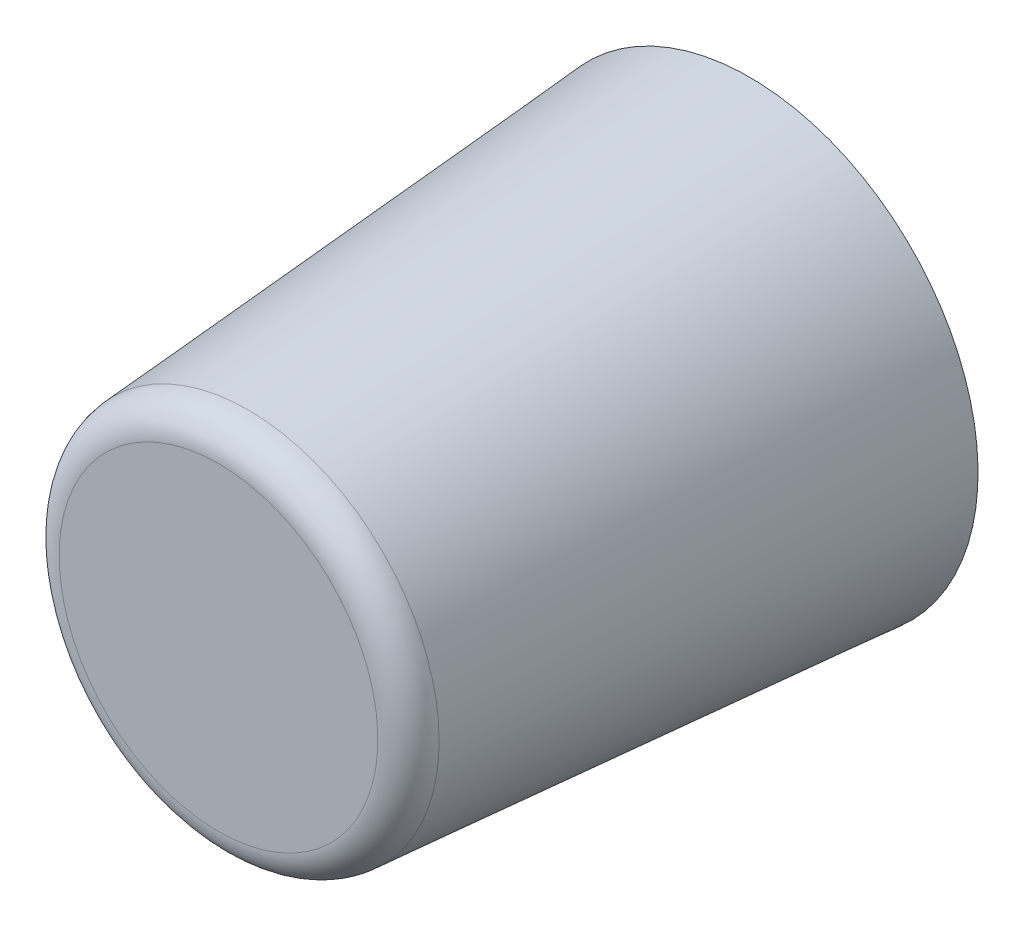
ISO-10303-21;
HEADER;
FILE_DESCRIPTION(('STEP AP214'),'2;1');
FILE_NAME('part.step','',(''),(''),'','','');
FILE_SCHEMA(('AUTOMOTIVE_DESIGN { 1 0 10303 214 1 1 1 1 }'));
ENDSEC;
DATA;
#1=APPLICATION_CONTEXT('core data for automotive mechanical design processes');
#2=APPLICATION_PROTOCOL_DEFINITION('international standard','automotive_design',2000,#1);
#3=PRODUCT_CONTEXT('',#1,'mechanical');
#4=PRODUCT('Part','Part','',(#3));
#5=PRODUCT_RELATED_PRODUCT_CATEGORY('part','',(#4));
#6=PRODUCT_DEFINITION_FORMATION('','',#4);
#7=PRODUCT_DEFINITION_CONTEXT('part definition',#1,'design');
#8=PRODUCT_DEFINITION('design','',#6,#7);
#9=PRODUCT_DEFINITION_SHAPE('','',#8);
#10=(LENGTH_UNIT() NAMED_UNIT(*) SI_UNIT(.MILLI.,.METRE.));
#11=(NAMED_UNIT(*) PLANE_ANGLE_UNIT() SI_UNIT($,.RADIAN.));
#12=(NAMED_UNIT(*) SI_UNIT($,.STERADIAN.) SOLID_ANGLE_UNIT());
#13=UNCERTAINTY_MEASURE_WITH_UNIT(LENGTH_MEASURE(1.E-05),#10,'distance_accuracy_value','');
#14=(GEOMETRIC_REPRESENTATION_CONTEXT(3) GLOBAL_UNCERTAINTY_ASSIGNED_CONTEXT((#13)) GLOBAL_UNIT_ASSIGNED_CONTEXT((#10,
#11,#12)) REPRESENTATION_CONTEXT('',''));
#15=CARTESIAN_POINT('',(0.,0.,0.));
#16=DIRECTION('',(0.,0.,1.));
#17=DIRECTION('',(1.,0.,0.));
#18=AXIS2_PLACEMENT_3D('',#15,#16,#17);
#19=CARTESIAN_POINT('',(0.,0.,50.));
#20=DIRECTION('',(0.,0.,1.));
#21=DIRECTION('',(0.,-1.,0.));
#22=AXIS2_PLACEMENT_3D('',#19,#20,#21);
#23=CYLINDRICAL_SURFACE('',#22,19.35);
#24=CARTESIAN_POINT('',(0.,0.,0.));
#25=DIRECTION('',(0.,0.,1.));
#26=DIRECTION('',(0.,-1.,0.));
#27=AXIS2_PLACEMENT_3D('',#24,#25,#26);
#28=CIRCLE('',#27,19.35);
#29=CARTESIAN_POINT('',(0.,-19.35,0.));
#30=VERTEX_POINT('',#29);
#31=EDGE_CURVE('E27',#30,#30,#28,.T.);
#32=ORIENTED_EDGE('',*,*,#31,.F.);
#33=EDGE_LOOP('',(#32));
#34=FACE_BOUND('',#33,.T.);
#35=CARTESIAN_POINT('',(0.,0.,0.0500000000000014));
#36=DIRECTION('',(0.,0.,1.));
#37=DIRECTION('',(0.,-1.,0.));
#38=AXIS2_PLACEMENT_3D('',#35,#36,#37);
#39=CIRCLE('',#38,19.35);
#40=CARTESIAN_POINT('',(0.,-19.35,0.0500000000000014));
#41=VERTEX_POINT('',#40);
#42=EDGE_CURVE('E44',#41,#41,#39,.T.);
#43=ORIENTED_EDGE('',*,*,#42,.T.);
#44=EDGE_LOOP('',(#43));
#45=FACE_BOUND('',#44,.T.);
#46=ADVANCED_FACE('F12',(#34,#45),#23,.F.);
#47=CARTESIAN_POINT('',(19.35,0.,0.));
#48=DIRECTION('',(0.,0.,1.));
#49=DIRECTION('',(0.,-1.,0.));
#50=AXIS2_PLACEMENT_3D('',#47,#48,#49);
#51=PLANE('',#50);
#52=CARTESIAN_POINT('',(0.,0.,0.));
#53=DIRECTION('',(0.,0.,1.));
#54=DIRECTION('',(0.,-1.,0.));
#55=AXIS2_PLACEMENT_3D('',#52,#53,#54);
#56=CIRCLE('',#55,21.5);
#57=CARTESIAN_POINT('',(0.,-21.5,0.));
#58=VERTEX_POINT('',#57);
#59=EDGE_CURVE('E32',#58,#58,#56,.T.);
#60=ORIENTED_EDGE('',*,*,#59,.F.);
#61=EDGE_LOOP('',(#60));
#62=FACE_BOUND('',#61,.T.);
#63=ORIENTED_EDGE('',*,*,#31,.T.);
#64=EDGE_LOOP('',(#63));
#65=FACE_BOUND('',#64,.T.);
#66=ADVANCED_FACE('F72',(#62,#65),#51,.F.);
#67=CARTESIAN_POINT('',(0.,0.,0.));
#68=DIRECTION('',(0.,0.,-1.));
#69=DIRECTION('',(0.,1.,0.));
#70=AXIS2_PLACEMENT_3D('',#67,#68,#69);
#71=CONICAL_SURFACE('',#70,21.5,0.0741559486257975);
#72=CARTESIAN_POINT('',(0.,0.,47.2222640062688));
#73=DIRECTION('',(0.,0.,1.));
#74=DIRECTION('',(0.,-1.,0.));
#75=AXIS2_PLACEMENT_3D('',#72,#73,#74);
#76=CIRCLE('',#75,17.9917551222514);
#77=CARTESIAN_POINT('',(0.,-17.9917551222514,47.2222640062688));
#78=VERTEX_POINT('',#77);
#79=EDGE_CURVE('E35',#78,#78,#76,.T.);
#80=ORIENTED_EDGE('',*,*,#79,.F.);
#81=EDGE_LOOP('',(#80));
#82=FACE_BOUND('',#81,.T.);
#83=ORIENTED_EDGE('',*,*,#59,.T.);
#84=EDGE_LOOP('',(#83));
#85=FACE_BOUND('',#84,.T.);
#86=ADVANCED_FACE('F77',(#82,#85),#71,.T.);
#87=CARTESIAN_POINT('',(0.,0.,47.));
#88=DIRECTION('',(0.,0.,1.));
#89=DIRECTION('',(0.,-1.,0.));
#90=AXIS2_PLACEMENT_3D('',#87,#88,#89);
#91=TOROIDAL_SURFACE('',#90,15.,3.);
#92=ORIENTED_EDGE('',*,*,#79,.T.);
#93=EDGE_LOOP('',(#92));
#94=FACE_BOUND('',#93,.T.);
#95=CARTESIAN_POINT('',(0.,0.,50.));
#96=DIRECTION('',(0.,0.,1.));
#97=DIRECTION('',(0.,-1.,0.));
#98=AXIS2_PLACEMENT_3D('',#95,#96,#97);
#99=CIRCLE('',#98,15.);
#100=CARTESIAN_POINT('',(0.,-15.,50.));
#101=VERTEX_POINT('',#100);
#102=EDGE_CURVE('E38',#101,#101,#99,.T.);
#103=ORIENTED_EDGE('',*,*,#102,.F.);
#104=EDGE_LOOP('',(#103));
#105=FACE_BOUND('',#104,.T.);
#106=ADVANCED_FACE('F84',(#94,#105),#91,.T.);
#107=CARTESIAN_POINT('',(15.,0.,50.));
#108=DIRECTION('',(0.,0.,-1.));
#109=DIRECTION('',(0.,1.,0.));
#110=AXIS2_PLACEMENT_3D('',#107,#108,#109);
#111=PLANE('',#110);
#112=ORIENTED_EDGE('',*,*,#102,.T.);
#113=EDGE_LOOP('',(#112));
#114=FACE_BOUND('',#113,.T.);
#115=ADVANCED_FACE('F59',(#114),#111,.F.);
#116=CARTESIAN_POINT('',(0.,0.,0.));
#117=DIRECTION('',(0.,0.,1.));
#118=DIRECTION('',(0.,-1.,0.));
#119=AXIS2_PLACEMENT_3D('',#116,#117,#118);
#120=PLANE('',#119);
#121=CARTESIAN_POINT('',(0.,0.,0.));
#122=DIRECTION('',(0.,0.,1.));
#123=DIRECTION('',(0.,-1.,0.));
#124=AXIS2_PLACEMENT_3D('',#121,#122,#123);
#125=CIRCLE('',#124,19.3);
#126=CARTESIAN_POINT('',(0.,-19.3,0.));
#127=VERTEX_POINT('',#126);
#128=EDGE_CURVE('E41',#127,#127,#125,.T.);
#129=ORIENTED_EDGE('',*,*,#128,.F.);
#130=EDGE_LOOP('',(#129));
#131=FACE_BOUND('',#130,.T.);
#132=CARTESIAN_POINT('',(0.,0.,0.));
#133=DIRECTION('',(0.,0.,1.));
#134=DIRECTION('',(0.,-1.,0.));
#135=AXIS2_PLACEMENT_3D('',#132,#133,#134);
#136=CIRCLE('',#135,5.);
#137=CARTESIAN_POINT('',(0.,-5.,0.));
#138=VERTEX_POINT('',#137);
#139=EDGE_CURVE('E23',#138,#138,#136,.T.);
#140=ORIENTED_EDGE('',*,*,#139,.T.);
#141=EDGE_LOOP('',(#140));
#142=FACE_BOUND('',#141,.T.);
#143=ADVANCED_FACE('F53',(#131,#142),#120,.F.);
#144=CARTESIAN_POINT('',(0.,0.,0.));
#145=DIRECTION('',(0.,0.,1.));
#146=DIRECTION('',(0.,-1.,0.));
#147=AXIS2_PLACEMENT_3D('',#144,#145,#146);
#148=CONICAL_SURFACE('',#147,19.3,0.785398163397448);
#149=ORIENTED_EDGE('',*,*,#42,.F.);
#150=EDGE_LOOP('',(#149));
#151=FACE_BOUND('',#150,.T.);
#152=ORIENTED_EDGE('',*,*,#128,.T.);
#153=EDGE_LOOP('',(#152));
#154=FACE_BOUND('',#153,.T.);
#155=ADVANCED_FACE('F49',(#151,#154),#148,.T.);
#156=CARTESIAN_POINT('',(0.,0.,50.));
#157=DIRECTION('',(0.,0.,1.));
#158=DIRECTION('',(0.,-1.,0.));
#159=AXIS2_PLACEMENT_3D('',#156,#157,#158);
#160=CYLINDRICAL_SURFACE('',#159,5.);
#161=CARTESIAN_POINT('',(0.,0.,-10.5));
#162=DIRECTION('',(0.,0.,1.));
#163=DIRECTION('',(0.,-1.,0.));
#164=AXIS2_PLACEMENT_3D('',#161,#162,#163);
#165=CIRCLE('',#164,5.);
#166=CARTESIAN_POINT('',(0.,-5.,-10.5));
#167=VERTEX_POINT('',#166);
#168=EDGE_CURVE('E8',#167,#167,#165,.T.);
#169=ORIENTED_EDGE('',*,*,#168,.T.);
#170=EDGE_LOOP('',(#169));
#171=FACE_BOUND('',#170,.T.);
#172=ORIENTED_EDGE('',*,*,#139,.F.);
#173=EDGE_LOOP('',(#172));
#174=FACE_BOUND('',#173,.T.);
#175=ADVANCED_FACE('F52',(#171,#174),#160,.T.);
#176=CARTESIAN_POINT('',(0.,0.,-12.));
#177=DIRECTION('',(0.,0.,1.));
#178=DIRECTION('',(0.,-1.,0.));
#179=AXIS2_PLACEMENT_3D('',#176,#177,#178);
#180=PLANE('',#179);
#181=CARTESIAN_POINT('',(0.,0.,-12.));
#182=DIRECTION('',(0.,0.,1.));
#183=DIRECTION('',(0.,-1.,0.));
#184=AXIS2_PLACEMENT_3D('',#181,#182,#183);
#185=CIRCLE('',#184,3.5);
#186=CARTESIAN_POINT('',(0.,-3.5,-12.));
#187=VERTEX_POINT('',#186);
#188=EDGE_CURVE('E19',#187,#187,#185,.F.);
#189=ORIENTED_EDGE('',*,*,#188,.T.);
#190=EDGE_LOOP('',(#189));
#191=FACE_BOUND('',#190,.T.);
#192=ADVANCED_FACE('F64',(#191),#180,.F.);
#193=CARTESIAN_POINT('',(0.,0.,-12.));
#194=DIRECTION('',(0.,0.,1.));
#195=DIRECTION('',(0.,-1.,0.));
#196=AXIS2_PLACEMENT_3D('',#193,#194,#195);
#197=CONICAL_SURFACE('',#196,3.5,0.785398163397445);
#198=ORIENTED_EDGE('',*,*,#168,.F.);
#199=EDGE_LOOP('',(#198));
#200=FACE_BOUND('',#199,.T.);
#201=ORIENTED_EDGE('',*,*,#188,.F.);
#202=EDGE_LOOP('',(#201));
#203=FACE_BOUND('',#202,.T.);
#204=ADVANCED_FACE('F14',(#200,#203),#197,.T.);
#205=CLOSED_SHELL('',(#46,#66,#86,#106,#115,#143,#155,#175,#192,#204));
#206=MANIFOLD_SOLID_BREP('B1',#205);
#207=ADVANCED_BREP_SHAPE_REPRESENTATION('',(#18,#206),#14);
#208=SHAPE_DEFINITION_REPRESENTATION(#9,#207);
ENDSEC;
END-ISO-10303-21;
